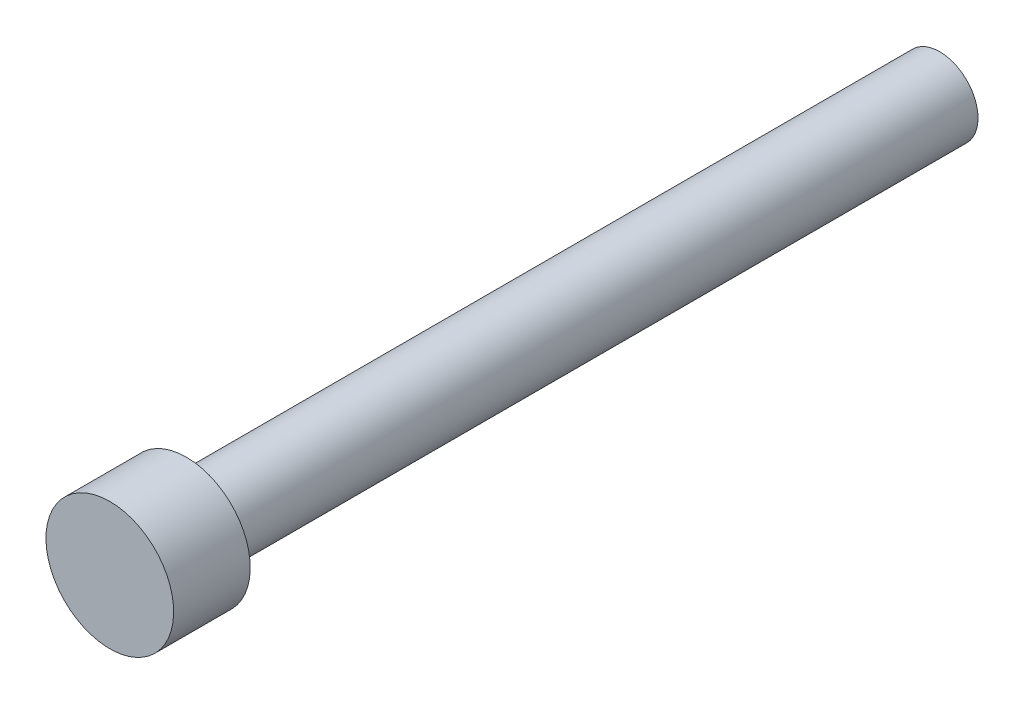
ISO-10303-21;
HEADER;
FILE_DESCRIPTION(('STEP AP214'),'2;1');
FILE_NAME('part.step','',(''),(''),'','','');
FILE_SCHEMA(('AUTOMOTIVE_DESIGN { 1 0 10303 214 1 1 1 1 }'));
ENDSEC;
DATA;
#1=APPLICATION_CONTEXT('core data for automotive mechanical design processes');
#2=APPLICATION_PROTOCOL_DEFINITION('international standard','automotive_design',2000,#1);
#3=PRODUCT_CONTEXT('',#1,'mechanical');
#4=PRODUCT('Part','Part','',(#3));
#5=PRODUCT_RELATED_PRODUCT_CATEGORY('part','',(#4));
#6=PRODUCT_DEFINITION_FORMATION('','',#4);
#7=PRODUCT_DEFINITION_CONTEXT('part definition',#1,'design');
#8=PRODUCT_DEFINITION('design','',#6,#7);
#9=PRODUCT_DEFINITION_SHAPE('','',#8);
#10=(LENGTH_UNIT() NAMED_UNIT(*) SI_UNIT(.MILLI.,.METRE.));
#11=(NAMED_UNIT(*) PLANE_ANGLE_UNIT() SI_UNIT($,.RADIAN.));
#12=(NAMED_UNIT(*) SI_UNIT($,.STERADIAN.) SOLID_ANGLE_UNIT());
#13=UNCERTAINTY_MEASURE_WITH_UNIT(LENGTH_MEASURE(1.E-05),#10,'distance_accuracy_value','');
#14=(GEOMETRIC_REPRESENTATION_CONTEXT(3) GLOBAL_UNCERTAINTY_ASSIGNED_CONTEXT((#13)) GLOBAL_UNIT_ASSIGNED_CONTEXT((#10,
#11,#12)) REPRESENTATION_CONTEXT('',''));
#15=CARTESIAN_POINT('',(0.,0.,0.));
#16=DIRECTION('',(0.,0.,1.));
#17=DIRECTION('',(1.,0.,0.));
#18=AXIS2_PLACEMENT_3D('',#15,#16,#17);
#19=CARTESIAN_POINT('',(0.,-5.,0.));
#20=DIRECTION('',(0.,0.,1.));
#21=DIRECTION('',(0.,-1.,0.));
#22=AXIS2_PLACEMENT_3D('',#19,#20,#21);
#23=PLANE('',#22);
#24=CARTESIAN_POINT('',(0.,-5.,0.));
#25=DIRECTION('',(0.,0.,-1.));
#26=DIRECTION('',(0.,1.,0.));
#27=AXIS2_PLACEMENT_3D('',#24,#25,#26);
#28=CIRCLE('',#27,5.);
#29=CARTESIAN_POINT('',(0.,0.,0.));
#30=VERTEX_POINT('',#29);
#31=EDGE_CURVE('E10',#30,#30,#28,.T.);
#32=ORIENTED_EDGE('',*,*,#31,.F.);
#33=EDGE_LOOP('',(#32));
#34=FACE_BOUND('',#33,.T.);
#35=ADVANCED_FACE('F31',(#34),#23,.T.);
#36=CARTESIAN_POINT('',(0.,-4.99999999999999,-65.));
#37=DIRECTION('',(0.,0.,-1.));
#38=DIRECTION('',(0.,1.,0.));
#39=AXIS2_PLACEMENT_3D('',#36,#37,#38);
#40=CYLINDRICAL_SURFACE('',#39,5.);
#41=ORIENTED_EDGE('',*,*,#31,.T.);
#42=EDGE_LOOP('',(#41));
#43=FACE_BOUND('',#42,.T.);
#44=CARTESIAN_POINT('',(0.,-5.,-6.));
#45=DIRECTION('',(0.,0.,-1.));
#46=DIRECTION('',(0.,1.,0.));
#47=AXIS2_PLACEMENT_3D('',#44,#45,#46);
#48=CIRCLE('',#47,5.);
#49=CARTESIAN_POINT('',(0.,0.,-6.));
#50=VERTEX_POINT('',#49);
#51=EDGE_CURVE('E37',#50,#50,#48,.T.);
#52=ORIENTED_EDGE('',*,*,#51,.F.);
#53=EDGE_LOOP('',(#52));
#54=FACE_BOUND('',#53,.T.);
#55=ADVANCED_FACE('F63',(#43,#54),#40,.T.);
#56=CARTESIAN_POINT('',(0.,0.,-6.));
#57=DIRECTION('',(0.,0.,-1.));
#58=DIRECTION('',(0.,1.,0.));
#59=AXIS2_PLACEMENT_3D('',#56,#57,#58);
#60=PLANE('',#59);
#61=ORIENTED_EDGE('',*,*,#51,.T.);
#62=EDGE_LOOP('',(#61));
#63=FACE_BOUND('',#62,.T.);
#64=CARTESIAN_POINT('',(0.,-5.,-6.));
#65=DIRECTION('',(0.,0.,-1.));
#66=DIRECTION('',(0.,1.,0.));
#67=AXIS2_PLACEMENT_3D('',#64,#65,#66);
#68=CIRCLE('',#67,3.);
#69=CARTESIAN_POINT('',(0.,-1.99999999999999,-6.));
#70=VERTEX_POINT('',#69);
#71=EDGE_CURVE('E41',#70,#70,#68,.T.);
#72=ORIENTED_EDGE('',*,*,#71,.F.);
#73=EDGE_LOOP('',(#72));
#74=FACE_BOUND('',#73,.T.);
#75=ADVANCED_FACE('F55',(#63,#74),#60,.T.);
#76=CARTESIAN_POINT('',(0.,-4.99999999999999,-65.));
#77=DIRECTION('',(0.,0.,-1.));
#78=DIRECTION('',(0.,1.,0.));
#79=AXIS2_PLACEMENT_3D('',#76,#77,#78);
#80=CYLINDRICAL_SURFACE('',#79,3.);
#81=ORIENTED_EDGE('',*,*,#71,.T.);
#82=EDGE_LOOP('',(#81));
#83=FACE_BOUND('',#82,.T.);
#84=CARTESIAN_POINT('',(0.,-4.99999999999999,-65.));
#85=DIRECTION('',(0.,0.,-1.));
#86=DIRECTION('',(0.,1.,0.));
#87=AXIS2_PLACEMENT_3D('',#84,#85,#86);
#88=CIRCLE('',#87,3.);
#89=CARTESIAN_POINT('',(0.,-1.99999999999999,-65.));
#90=VERTEX_POINT('',#89);
#91=EDGE_CURVE('E45',#90,#90,#88,.T.);
#92=ORIENTED_EDGE('',*,*,#91,.F.);
#93=EDGE_LOOP('',(#92));
#94=FACE_BOUND('',#93,.T.);
#95=ADVANCED_FACE('F53',(#83,#94),#80,.T.);
#96=CARTESIAN_POINT('',(0.,-1.99999999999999,-65.));
#97=DIRECTION('',(0.,0.,-1.));
#98=DIRECTION('',(0.,1.,0.));
#99=AXIS2_PLACEMENT_3D('',#96,#97,#98);
#100=PLANE('',#99);
#101=ORIENTED_EDGE('',*,*,#91,.T.);
#102=EDGE_LOOP('',(#101));
#103=FACE_BOUND('',#102,.T.);
#104=ADVANCED_FACE('F51',(#103),#100,.T.);
#105=CLOSED_SHELL('',(#35,#55,#75,#95,#104));
#106=MANIFOLD_SOLID_BREP('B2',#105);
#107=ADVANCED_BREP_SHAPE_REPRESENTATION('',(#18,#106),#14);
#108=SHAPE_DEFINITION_REPRESENTATION(#9,#107);
ENDSEC;
END-ISO-10303-21;
